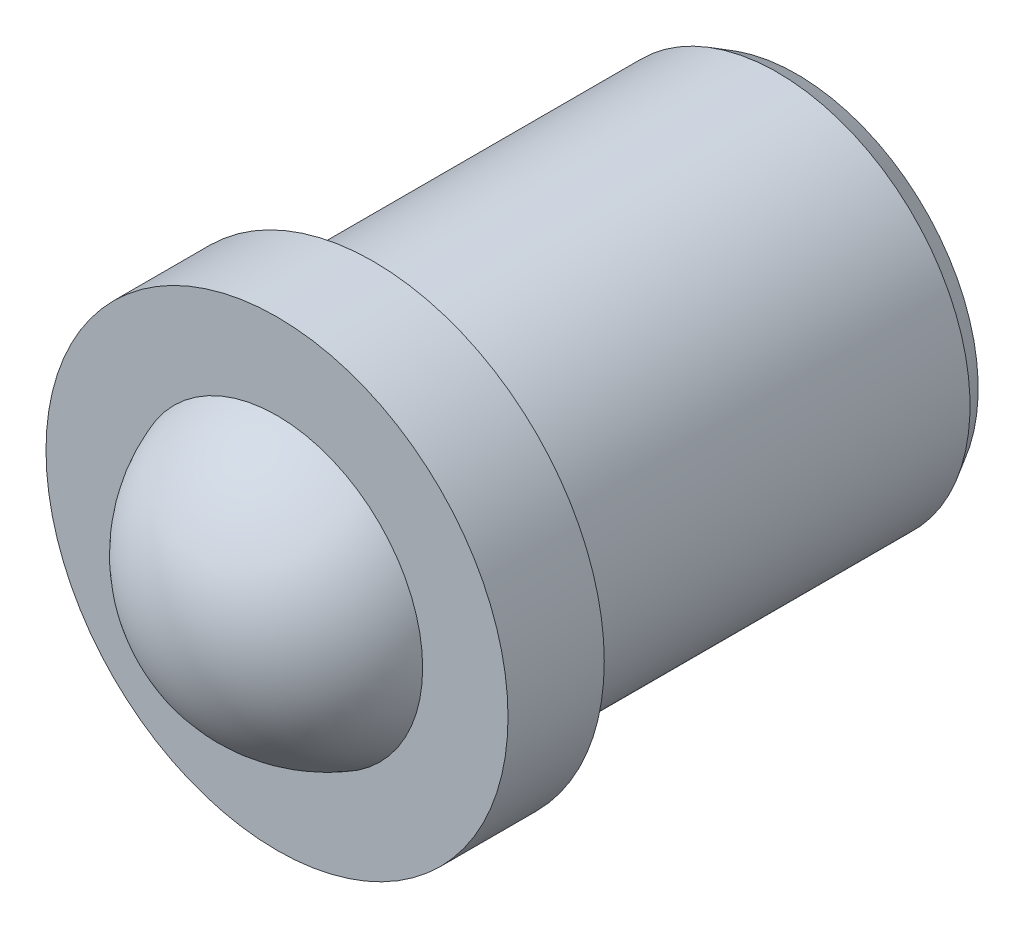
ISO-10303-21;
HEADER;
FILE_DESCRIPTION(('STEP AP214'),'2;1');
FILE_NAME('part.step','',(''),(''),'','','');
FILE_SCHEMA(('AUTOMOTIVE_DESIGN { 1 0 10303 214 1 1 1 1 }'));
ENDSEC;
DATA;
#1=APPLICATION_CONTEXT('core data for automotive mechanical design processes');
#2=APPLICATION_PROTOCOL_DEFINITION('international standard','automotive_design',2000,#1);
#3=PRODUCT_CONTEXT('',#1,'mechanical');
#4=PRODUCT('Part','Part','',(#3));
#5=PRODUCT_RELATED_PRODUCT_CATEGORY('part','',(#4));
#6=PRODUCT_DEFINITION_FORMATION('','',#4);
#7=PRODUCT_DEFINITION_CONTEXT('part definition',#1,'design');
#8=PRODUCT_DEFINITION('design','',#6,#7);
#9=PRODUCT_DEFINITION_SHAPE('','',#8);
#10=(LENGTH_UNIT() NAMED_UNIT(*) SI_UNIT(.MILLI.,.METRE.));
#11=(NAMED_UNIT(*) PLANE_ANGLE_UNIT() SI_UNIT($,.RADIAN.));
#12=(NAMED_UNIT(*) SI_UNIT($,.STERADIAN.) SOLID_ANGLE_UNIT());
#13=UNCERTAINTY_MEASURE_WITH_UNIT(LENGTH_MEASURE(1.E-05),#10,'distance_accuracy_value','');
#14=(GEOMETRIC_REPRESENTATION_CONTEXT(3) GLOBAL_UNCERTAINTY_ASSIGNED_CONTEXT((#13)) GLOBAL_UNIT_ASSIGNED_CONTEXT((#10,
#11,#12)) REPRESENTATION_CONTEXT('',''));
#15=CARTESIAN_POINT('',(0.,0.,0.));
#16=DIRECTION('',(0.,0.,1.));
#17=DIRECTION('',(1.,0.,0.));
#18=AXIS2_PLACEMENT_3D('',#15,#16,#17);
#19=CARTESIAN_POINT('',(0.,0.,1.1910299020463));
#20=DIRECTION('',(0.,0.,-1.));
#21=DIRECTION('',(0.,-1.,0.));
#22=AXIS2_PLACEMENT_3D('',#19,#20,#21);
#23=SPHERICAL_SURFACE('',#22,4.00292427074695);
#24=CARTESIAN_POINT('',(0.,0.,2.5));
#25=DIRECTION('',(0.,0.,-1.));
#26=DIRECTION('',(-1.,0.,0.));
#27=AXIS2_PLACEMENT_3D('',#24,#25,#26);
#28=CIRCLE('',#27,3.78285606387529);
#29=CARTESIAN_POINT('',(-3.78285606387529,0.,2.5));
#30=VERTEX_POINT('',#29);
#31=EDGE_CURVE('E34',#30,#30,#28,.T.);
#32=ORIENTED_EDGE('',*,*,#31,.F.);
#33=EDGE_LOOP('',(#32));
#34=FACE_BOUND('',#33,.T.);
#35=ADVANCED_FACE('F12',(#34),#23,.T.);
#36=CARTESIAN_POINT('',(0.,0.,-11.));
#37=DIRECTION('',(0.,0.,-1.));
#38=DIRECTION('',(-1.,0.,0.));
#39=AXIS2_PLACEMENT_3D('',#36,#37,#38);
#40=PLANE('',#39);
#41=CARTESIAN_POINT('',(0.,0.,-11.));
#42=DIRECTION('',(0.,0.,-1.));
#43=DIRECTION('',(-1.,0.,0.));
#44=AXIS2_PLACEMENT_3D('',#41,#42,#43);
#45=CIRCLE('',#44,4.71132);
#46=CARTESIAN_POINT('',(-4.71132,0.,-11.));
#47=VERTEX_POINT('',#46);
#48=EDGE_CURVE('E8',#47,#47,#45,.T.);
#49=ORIENTED_EDGE('',*,*,#48,.T.);
#50=EDGE_LOOP('',(#49));
#51=FACE_BOUND('',#50,.T.);
#52=ADVANCED_FACE('F42',(#51),#40,.T.);
#53=CARTESIAN_POINT('',(0.,0.,-11.));
#54=DIRECTION('',(0.,0.,1.));
#55=DIRECTION('',(1.,0.,0.));
#56=AXIS2_PLACEMENT_3D('',#53,#54,#55);
#57=CONICAL_SURFACE('',#56,4.71132,0.523606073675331);
#58=CARTESIAN_POINT('',(0.,0.,-10.5));
#59=DIRECTION('',(0.,0.,-1.));
#60=DIRECTION('',(-1.,0.,0.));
#61=AXIS2_PLACEMENT_3D('',#58,#59,#60);
#62=CIRCLE('',#61,5.);
#63=CARTESIAN_POINT('',(-5.,0.,-10.5));
#64=VERTEX_POINT('',#63);
#65=EDGE_CURVE('E18',#64,#64,#62,.T.);
#66=ORIENTED_EDGE('',*,*,#65,.T.);
#67=EDGE_LOOP('',(#66));
#68=FACE_BOUND('',#67,.T.);
#69=ORIENTED_EDGE('',*,*,#48,.F.);
#70=EDGE_LOOP('',(#69));
#71=FACE_BOUND('',#70,.T.);
#72=ADVANCED_FACE('F48',(#68,#71),#57,.T.);
#73=CARTESIAN_POINT('',(0.,0.,-11.));
#74=DIRECTION('',(0.,0.,-1.));
#75=DIRECTION('',(-1.,0.,0.));
#76=AXIS2_PLACEMENT_3D('',#73,#74,#75);
#77=CYLINDRICAL_SURFACE('',#76,5.);
#78=CARTESIAN_POINT('',(0.,0.,0.));
#79=DIRECTION('',(0.,0.,-1.));
#80=DIRECTION('',(-1.,0.,0.));
#81=AXIS2_PLACEMENT_3D('',#78,#79,#80);
#82=CIRCLE('',#81,5.);
#83=CARTESIAN_POINT('',(-5.,0.,0.));
#84=VERTEX_POINT('',#83);
#85=EDGE_CURVE('E22',#84,#84,#82,.T.);
#86=ORIENTED_EDGE('',*,*,#85,.T.);
#87=EDGE_LOOP('',(#86));
#88=FACE_BOUND('',#87,.T.);
#89=ORIENTED_EDGE('',*,*,#65,.F.);
#90=EDGE_LOOP('',(#89));
#91=FACE_BOUND('',#90,.T.);
#92=ADVANCED_FACE('F53',(#88,#91),#77,.T.);
#93=CARTESIAN_POINT('',(0.,-5.,0.));
#94=DIRECTION('',(0.,0.,-1.));
#95=DIRECTION('',(-1.,0.,0.));
#96=AXIS2_PLACEMENT_3D('',#93,#94,#95);
#97=PLANE('',#96);
#98=CARTESIAN_POINT('',(0.,0.,0.));
#99=DIRECTION('',(0.,0.,-1.));
#100=DIRECTION('',(-1.,0.,0.));
#101=AXIS2_PLACEMENT_3D('',#98,#99,#100);
#102=CIRCLE('',#101,6.);
#103=CARTESIAN_POINT('',(-6.,0.,0.));
#104=VERTEX_POINT('',#103);
#105=EDGE_CURVE('E26',#104,#104,#102,.T.);
#106=ORIENTED_EDGE('',*,*,#105,.T.);
#107=EDGE_LOOP('',(#106));
#108=FACE_BOUND('',#107,.T.);
#109=ORIENTED_EDGE('',*,*,#85,.F.);
#110=EDGE_LOOP('',(#109));
#111=FACE_BOUND('',#110,.T.);
#112=ADVANCED_FACE('F58',(#108,#111),#97,.T.);
#113=CARTESIAN_POINT('',(0.,0.,-11.));
#114=DIRECTION('',(0.,0.,-1.));
#115=DIRECTION('',(-1.,0.,0.));
#116=AXIS2_PLACEMENT_3D('',#113,#114,#115);
#117=CYLINDRICAL_SURFACE('',#116,6.);
#118=CARTESIAN_POINT('',(0.,0.,2.5));
#119=DIRECTION('',(0.,0.,-1.));
#120=DIRECTION('',(-1.,0.,0.));
#121=AXIS2_PLACEMENT_3D('',#118,#119,#120);
#122=CIRCLE('',#121,6.);
#123=CARTESIAN_POINT('',(-6.,0.,2.5));
#124=VERTEX_POINT('',#123);
#125=EDGE_CURVE('E31',#124,#124,#122,.T.);
#126=ORIENTED_EDGE('',*,*,#125,.T.);
#127=EDGE_LOOP('',(#126));
#128=FACE_BOUND('',#127,.T.);
#129=ORIENTED_EDGE('',*,*,#105,.F.);
#130=EDGE_LOOP('',(#129));
#131=FACE_BOUND('',#130,.T.);
#132=ADVANCED_FACE('F62',(#128,#131),#117,.T.);
#133=CARTESIAN_POINT('',(0.,-3.78285606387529,2.5));
#134=DIRECTION('',(0.,0.,1.));
#135=DIRECTION('',(1.,0.,0.));
#136=AXIS2_PLACEMENT_3D('',#133,#134,#135);
#137=PLANE('',#136);
#138=ORIENTED_EDGE('',*,*,#31,.T.);
#139=EDGE_LOOP('',(#138));
#140=FACE_BOUND('',#139,.T.);
#141=ORIENTED_EDGE('',*,*,#125,.F.);
#142=EDGE_LOOP('',(#141));
#143=FACE_BOUND('',#142,.T.);
#144=ADVANCED_FACE('F38',(#140,#143),#137,.T.);
#145=CLOSED_SHELL('',(#35,#52,#72,#92,#112,#132,#144));
#146=MANIFOLD_SOLID_BREP('B1',#145);
#147=ADVANCED_BREP_SHAPE_REPRESENTATION('',(#18,#146),#14);
#148=SHAPE_DEFINITION_REPRESENTATION(#9,#147);
ENDSEC;
END-ISO-10303-21;
